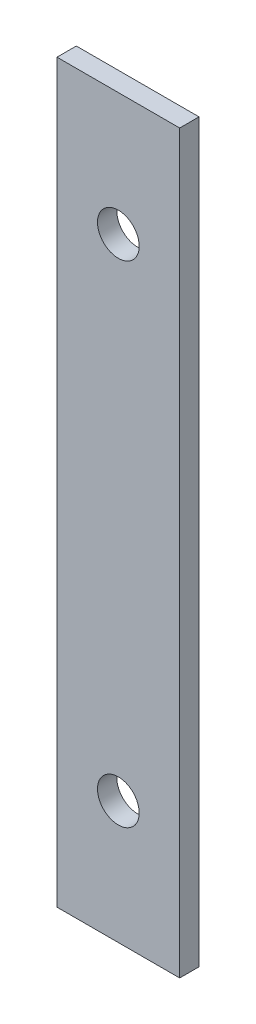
from build123d import *

# Parameters (mm, degrees)
SKETCH1_W            = 10
SKETCH1_H            = 60
BOSS_EXTRUDE1_DEPTH  = 1.5748
M3_CLEARANCE_HOLE1_D = 3.4


with BuildPart() as part:
    # Sketch1 → Boss-Extrude1 (new body)
    with BuildSketch(Plane.XY):
        Rectangle(SKETCH1_W, SKETCH1_H)
    extrude(amount=BOSS_EXTRUDE1_DEPTH)

    # M3 Clearance Hole1 (through all)
    with Locations(Plane.XY.offset(1.5748)):
        with Locations((0, 20), (0, -20)):
            Hole(M3_CLEARANCE_HOLE1_D / 2)


solid = part.part
